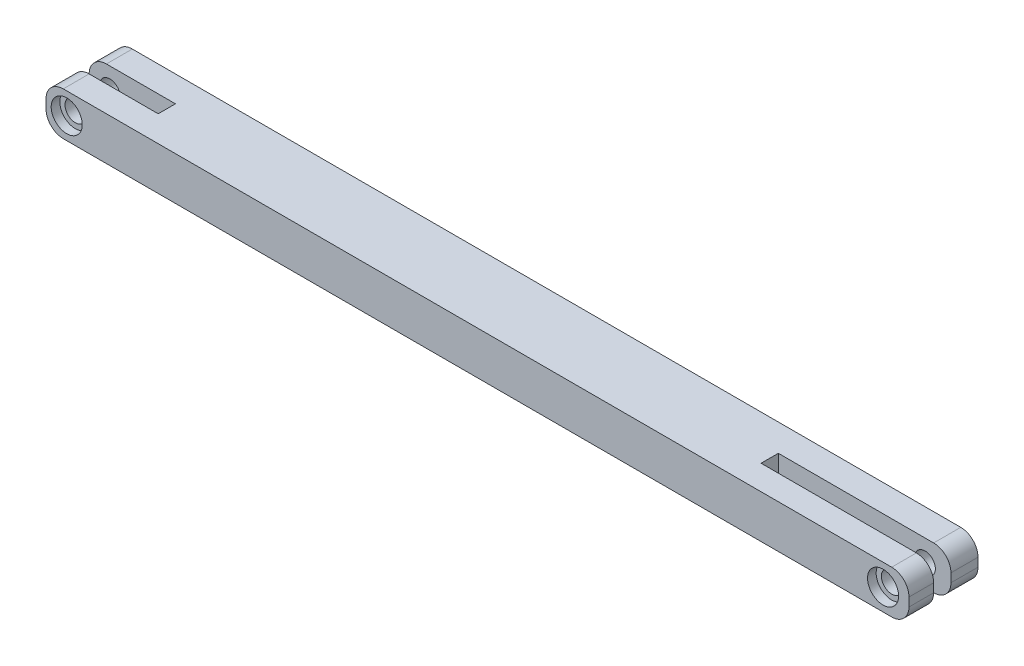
from build123d import *

# Parameters (mm, degrees)
SKETCH1_R           = 6
BOSS_EXTRUDE2_DEPTH = 40
SKETCH2_W           = 10
SKETCH2_H           = 25
CUT_EXTRUDE1_DEPTH  = 50
SKETCH5_W           = 10
SKETCH5_H           = 25
CUT_EXTRUDE3_DEPTH  = 100
SKETCH4_R           = 9
CUT_EXTRUDE4_DEPTH  = 5
SKETCH8_R           = 9
CUT_EXTRUDE7_DEPTH  = 5
CUT_EXTRUDE8_START  = -5
SKETCH9_R           = 9
CUT_EXTRUDE8_DEPTH  = 5
SKETCH6_R           = 6
CUT_EXTRUDE9_DEPTH  = 10
CUT_EXTRUDE10_START = -5
SKETCH10_R          = 9
CUT_EXTRUDE10_DEPTH = 5
CUT_EXTRUDE11_START = -10
SKETCH11_R          = 6
CUT_EXTRUDE11_DEPTH = 10


with BuildPart() as part:
    # Sketch1 → Boss-Extrude2 (new body)
    with BuildSketch(Plane.XY):
        with BuildLine():
            Line((10, 0), (490, 0))
            ThreePointArc((490, 0), (497.071067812, 2.928932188), (500, 10))
            Line((500, 10), (500, 15))
            ThreePointArc((500, 15), (497.071067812, 22.071067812), (490, 25))
            Line((490, 25), (10, 25))
            ThreePointArc((10, 25), (2.928932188, 22.071067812), (0, 15))
            Line((0, 15), (0, 10))
            ThreePointArc((0, 10), (2.928932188, 2.928932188), (10, 0))
        make_face()
        with Locations((485, 12.5)):
            Circle(SKETCH1_R, mode=Mode.SUBTRACT)
    extrude(amount=BOSS_EXTRUDE2_DEPTH)

    # Sketch2 → Cut-Extrude1 (cut)
    with BuildSketch(Plane.ZY):
        with Locations((20, 12.5)):
            Rectangle(SKETCH2_W, SKETCH2_H)
    extrude(amount=-CUT_EXTRUDE1_DEPTH, mode=Mode.SUBTRACT)

    # Sketch5 → Cut-Extrude3 (cut)
    with BuildSketch(Plane(origin=(500, 0, 0), x_dir=(0, 0, -1), z_dir=(1, 0, 0))):
        with Locations((-20.693451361, 12.5)):
            Rectangle(SKETCH5_W, SKETCH5_H)
    extrude(amount=-CUT_EXTRUDE3_DEPTH, mode=Mode.SUBTRACT)

    # Sketch4 → Cut-Extrude4 (cut)
    with BuildSketch(Plane.XY.offset(40)):
        with Locations((12, 12.5)):
            Circle(SKETCH4_R)
    extrude(amount=-CUT_EXTRUDE4_DEPTH, mode=Mode.SUBTRACT)

    # Sketch8 → Cut-Extrude7 (cut)
    with BuildSketch(Plane.XY.offset(40)):
        with Locations((485, 12.5)):
            Circle(SKETCH8_R)
    extrude(amount=-CUT_EXTRUDE7_DEPTH, mode=Mode.SUBTRACT)

    # Sketch9 → Cut-Extrude8 (cut)
    with BuildSketch(Plane(origin=(0, 0, 0), x_dir=(-1, 0, 0), z_dir=(0, 0, -1)).offset(CUT_EXTRUDE8_START)):
        with Locations(Location((-485, 12.5, 0), (0, 0, 180))):
            Circle(SKETCH9_R)
    extrude(amount=CUT_EXTRUDE8_DEPTH, mode=Mode.SUBTRACT)

    # Sketch6 → Cut-Extrude9 (cut)
    with BuildSketch(Plane.XY.offset(35)):
        with Locations((12, 12.5)):
            Circle(SKETCH6_R)
    extrude(amount=-CUT_EXTRUDE9_DEPTH, mode=Mode.SUBTRACT)

    # Sketch10 → Cut-Extrude10 (cut)
    with BuildSketch(Plane(origin=(0, 0, 0), x_dir=(-1, 0, 0), z_dir=(0, 0, -1)).offset(CUT_EXTRUDE10_START)):
        with Locations(Location((-12, 12.5, 0), (0, 0, 180))):
            Circle(SKETCH10_R)
    extrude(amount=CUT_EXTRUDE10_DEPTH, mode=Mode.SUBTRACT)

    # Sketch11 → Cut-Extrude11 (cut)
    with BuildSketch(Plane(origin=(0, 0, 5), x_dir=(-1, 0, 0), z_dir=(0, 0, -1)).offset(CUT_EXTRUDE11_START)):
        with Locations(Location((-12, 12.5, 0), (0, 0, 180))):
            Circle(SKETCH11_R)
    extrude(amount=CUT_EXTRUDE11_DEPTH, mode=Mode.SUBTRACT)


solid = part.part
